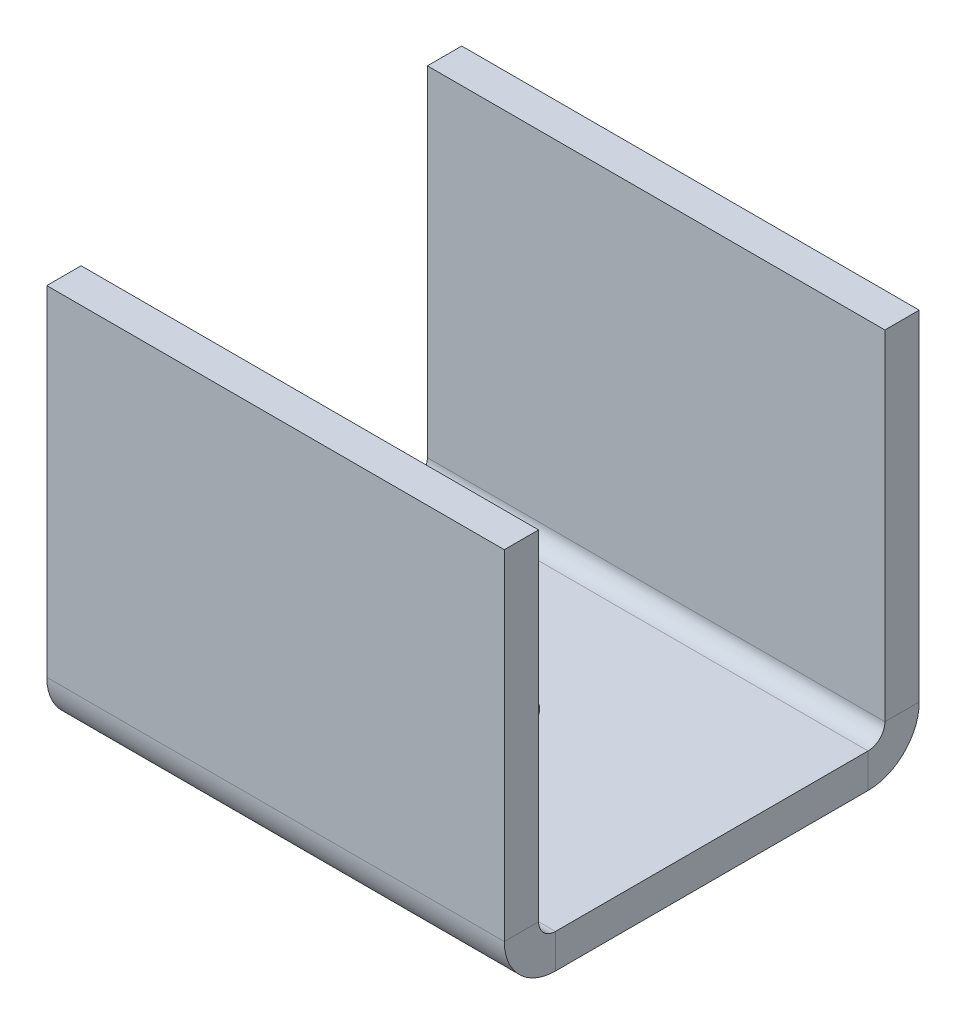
ISO-10303-21;
HEADER;
FILE_DESCRIPTION(('STEP AP214'),'2;1');
FILE_NAME('part.step','',(''),(''),'','','');
FILE_SCHEMA(('AUTOMOTIVE_DESIGN { 1 0 10303 214 1 1 1 1 }'));
ENDSEC;
DATA;
#1=APPLICATION_CONTEXT('core data for automotive mechanical design processes');
#2=APPLICATION_PROTOCOL_DEFINITION('international standard','automotive_design',2000,#1);
#3=PRODUCT_CONTEXT('',#1,'mechanical');
#4=PRODUCT('Part','Part','',(#3));
#5=PRODUCT_RELATED_PRODUCT_CATEGORY('part','',(#4));
#6=PRODUCT_DEFINITION_FORMATION('','',#4);
#7=PRODUCT_DEFINITION_CONTEXT('part definition',#1,'design');
#8=PRODUCT_DEFINITION('design','',#6,#7);
#9=PRODUCT_DEFINITION_SHAPE('','',#8);
#10=(LENGTH_UNIT() NAMED_UNIT(*) SI_UNIT(.MILLI.,.METRE.));
#11=(NAMED_UNIT(*) PLANE_ANGLE_UNIT() SI_UNIT($,.RADIAN.));
#12=(NAMED_UNIT(*) SI_UNIT($,.STERADIAN.) SOLID_ANGLE_UNIT());
#13=UNCERTAINTY_MEASURE_WITH_UNIT(LENGTH_MEASURE(1.E-05),#10,'distance_accuracy_value','');
#14=(GEOMETRIC_REPRESENTATION_CONTEXT(3) GLOBAL_UNCERTAINTY_ASSIGNED_CONTEXT((#13)) GLOBAL_UNIT_ASSIGNED_CONTEXT((#10,
#11,#12)) REPRESENTATION_CONTEXT('',''));
#15=CARTESIAN_POINT('',(0.,0.,0.));
#16=DIRECTION('',(0.,0.,1.));
#17=DIRECTION('',(1.,0.,0.));
#18=AXIS2_PLACEMENT_3D('',#15,#16,#17);
#19=CARTESIAN_POINT('',(0.,0.,-48.));
#20=DIRECTION('',(0.,-1.,0.));
#21=DIRECTION('',(0.,0.,-1.));
#22=AXIS2_PLACEMENT_3D('',#19,#20,#21);
#23=PLANE('',#22);
#24=CARTESIAN_POINT('',(10.,0.,-24.));
#25=DIRECTION('',(0.,1.,0.));
#26=DIRECTION('',(0.,0.,1.));
#27=AXIS2_PLACEMENT_3D('',#24,#25,#26);
#28=CIRCLE('',#27,1.75);
#29=CARTESIAN_POINT('',(10.,0.,-22.25));
#30=VERTEX_POINT('',#29);
#31=EDGE_CURVE('E230',#30,#30,#28,.T.);
#32=ORIENTED_EDGE('',*,*,#31,.T.);
#33=EDGE_LOOP('',(#32));
#34=FACE_BOUND('',#33,.T.);
#35=DIRECTION('',(0.,0.,1.));
#36=VECTOR('',#35,1.);
#37=CARTESIAN_POINT('',(0.,0.,0.));
#38=LINE('',#37,#36);
#39=CARTESIAN_POINT('',(0.,0.,-30.8324270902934));
#40=VERTEX_POINT('',#39);
#41=CARTESIAN_POINT('',(0.,1.20171815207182E-08,-17.1675729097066));
#42=VERTEX_POINT('',#41);
#43=EDGE_CURVE('E69',#40,#42,#38,.T.);
#44=ORIENTED_EDGE('',*,*,#43,.F.);
#45=DIRECTION('',(1.,0.,0.));
#46=VECTOR('',#45,1.);
#47=CARTESIAN_POINT('',(0.,0.,-30.8324270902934));
#48=LINE('',#47,#46);
#49=CARTESIAN_POINT('',(20.,0.,-30.8324270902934));
#50=VERTEX_POINT('',#49);
#51=EDGE_CURVE('E61',#40,#50,#48,.T.);
#52=ORIENTED_EDGE('',*,*,#51,.T.);
#53=DIRECTION('',(0.,0.,-1.));
#54=VECTOR('',#53,1.);
#55=CARTESIAN_POINT('',(20.,0.,0.));
#56=LINE('',#55,#54);
#57=CARTESIAN_POINT('',(20.,0.,-17.1675729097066));
#58=VERTEX_POINT('',#57);
#59=EDGE_CURVE('E77',#58,#50,#56,.T.);
#60=ORIENTED_EDGE('',*,*,#59,.F.);
#61=DIRECTION('',(1.,0.,0.));
#62=VECTOR('',#61,1.);
#63=CARTESIAN_POINT('',(0.,0.,-17.1675729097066));
#64=LINE('',#63,#62);
#65=EDGE_CURVE('E243',#42,#58,#64,.T.);
#66=ORIENTED_EDGE('',*,*,#65,.F.);
#67=EDGE_LOOP('',(#44,#52,#60,#66));
#68=FACE_BOUND('',#67,.T.);
#69=ADVANCED_FACE('F52',(#34,#68),#23,.T.);
#70=CARTESIAN_POINT('',(20.,1.5,0.));
#71=DIRECTION('',(-1.,0.,0.));
#72=DIRECTION('',(0.,0.,1.));
#73=AXIS2_PLACEMENT_3D('',#70,#71,#72);
#74=PLANE('',#73);
#75=DIRECTION('',(0.,-1.,0.));
#76=VECTOR('',#75,1.);
#77=CARTESIAN_POINT('',(20.,1.5,-30.8324270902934));
#78=LINE('',#77,#76);
#79=CARTESIAN_POINT('',(20.,1.5,-30.8324270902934));
#80=VERTEX_POINT('',#79);
#81=EDGE_CURVE('E250',#80,#50,#78,.T.);
#82=ORIENTED_EDGE('',*,*,#81,.F.);
#83=DIRECTION('',(0.,0.,-1.));
#84=VECTOR('',#83,1.);
#85=CARTESIAN_POINT('',(20.,1.5,0.));
#86=LINE('',#85,#84);
#87=CARTESIAN_POINT('',(20.,1.50000000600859,-17.1675729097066));
#88=VERTEX_POINT('',#87);
#89=EDGE_CURVE('E240',#88,#80,#86,.T.);
#90=ORIENTED_EDGE('',*,*,#89,.F.);
#91=DIRECTION('',(0.,-1.,0.));
#92=VECTOR('',#91,1.);
#93=CARTESIAN_POINT('',(20.,1.5,-17.1675729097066));
#94=LINE('',#93,#92);
#95=EDGE_CURVE('E245',#88,#58,#94,.T.);
#96=ORIENTED_EDGE('',*,*,#95,.T.);
#97=ORIENTED_EDGE('',*,*,#59,.T.);
#98=EDGE_LOOP('',(#82,#90,#96,#97));
#99=FACE_BOUND('',#98,.T.);
#100=ADVANCED_FACE('F298',(#99),#74,.F.);
#101=CARTESIAN_POINT('',(0.,1.5,0.));
#102=DIRECTION('',(1.,0.,0.));
#103=DIRECTION('',(0.,0.,-1.));
#104=AXIS2_PLACEMENT_3D('',#101,#102,#103);
#105=PLANE('',#104);
#106=DIRECTION('',(0.,1.,0.));
#107=VECTOR('',#106,1.);
#108=CARTESIAN_POINT('',(0.,1.5,-30.8324270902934));
#109=LINE('',#108,#107);
#110=CARTESIAN_POINT('',(0.,1.49999998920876,-30.8324270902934));
#111=VERTEX_POINT('',#110);
#112=EDGE_CURVE('E14',#40,#111,#109,.T.);
#113=ORIENTED_EDGE('',*,*,#112,.F.);
#114=ORIENTED_EDGE('',*,*,#43,.T.);
#115=DIRECTION('',(0.,1.,0.));
#116=VECTOR('',#115,1.);
#117=CARTESIAN_POINT('',(0.,1.5,-17.1675729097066));
#118=LINE('',#117,#116);
#119=CARTESIAN_POINT('',(0.,1.50000000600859,-17.1675729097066));
#120=VERTEX_POINT('',#119);
#121=EDGE_CURVE('E239',#42,#120,#118,.T.);
#122=ORIENTED_EDGE('',*,*,#121,.T.);
#123=DIRECTION('',(0.,0.,1.));
#124=VECTOR('',#123,1.);
#125=CARTESIAN_POINT('',(0.,1.5,0.));
#126=LINE('',#125,#124);
#127=EDGE_CURVE('E56',#111,#120,#126,.T.);
#128=ORIENTED_EDGE('',*,*,#127,.F.);
#129=EDGE_LOOP('',(#113,#114,#122,#128));
#130=FACE_BOUND('',#129,.T.);
#131=ADVANCED_FACE('F54',(#130),#105,.F.);
#132=CARTESIAN_POINT('',(0.,1.5,-48.));
#133=DIRECTION('',(0.,-1.,0.));
#134=DIRECTION('',(0.,0.,-1.));
#135=AXIS2_PLACEMENT_3D('',#132,#133,#134);
#136=PLANE('',#135);
#137=DIRECTION('',(1.,0.,0.));
#138=VECTOR('',#137,1.);
#139=CARTESIAN_POINT('',(0.,1.5,-30.8324270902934));
#140=LINE('',#139,#138);
#141=EDGE_CURVE('E247',#111,#80,#140,.T.);
#142=ORIENTED_EDGE('',*,*,#141,.F.);
#143=ORIENTED_EDGE('',*,*,#127,.T.);
#144=DIRECTION('',(1.,0.,0.));
#145=VECTOR('',#144,1.);
#146=CARTESIAN_POINT('',(0.,1.5,-17.1675729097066));
#147=LINE('',#146,#145);
#148=EDGE_CURVE('E236',#120,#88,#147,.T.);
#149=ORIENTED_EDGE('',*,*,#148,.T.);
#150=ORIENTED_EDGE('',*,*,#89,.T.);
#151=EDGE_LOOP('',(#142,#143,#149,#150));
#152=FACE_BOUND('',#151,.T.);
#153=CARTESIAN_POINT('',(10.,1.5,-24.));
#154=DIRECTION('',(0.,1.,0.));
#155=DIRECTION('',(0.,0.,1.));
#156=AXIS2_PLACEMENT_3D('',#153,#154,#155);
#157=CIRCLE('',#156,1.75);
#158=CARTESIAN_POINT('',(10.,1.5,-22.25));
#159=VERTEX_POINT('',#158);
#160=EDGE_CURVE('E233',#159,#159,#157,.T.);
#161=ORIENTED_EDGE('',*,*,#160,.F.);
#162=EDGE_LOOP('',(#161));
#163=FACE_BOUND('',#162,.T.);
#164=ADVANCED_FACE('F259',(#152,#163),#136,.F.);
#165=CARTESIAN_POINT('',(10.,1.5,-24.));
#166=DIRECTION('',(0.,-1.,0.));
#167=DIRECTION('',(0.,0.,-1.));
#168=AXIS2_PLACEMENT_3D('',#165,#166,#167);
#169=CYLINDRICAL_SURFACE('',#168,1.75);
#170=ORIENTED_EDGE('',*,*,#160,.T.);
#171=EDGE_LOOP('',(#170));
#172=FACE_BOUND('',#171,.T.);
#173=ORIENTED_EDGE('',*,*,#31,.F.);
#174=EDGE_LOOP('',(#173));
#175=FACE_BOUND('',#174,.T.);
#176=ADVANCED_FACE('F307',(#172,#175),#169,.F.);
#177=CARTESIAN_POINT('',(0.,2.23659998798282,-17.1675729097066));
#178=DIRECTION('',(1.,0.,0.));
#179=DIRECTION('',(0.,0.,-1.));
#180=AXIS2_PLACEMENT_3D('',#177,#178,#179);
#181=PLANE('',#180);
#182=ORIENTED_EDGE('',*,*,#121,.F.);
#183=CARTESIAN_POINT('',(0.,2.2366,-17.1675729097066));
#184=DIRECTION('',(1.,0.,0.));
#185=DIRECTION('',(0.,0.,-1.));
#186=AXIS2_PLACEMENT_3D('',#183,#184,#185);
#187=CIRCLE('',#186,2.23659998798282);
#188=CARTESIAN_POINT('',(0.,2.23660000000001,-14.9309729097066));
#189=VERTEX_POINT('',#188);
#190=EDGE_CURVE('E190',#42,#189,#187,.F.);
#191=ORIENTED_EDGE('',*,*,#190,.T.);
#192=DIRECTION('',(0.,0.,-1.));
#193=VECTOR('',#192,1.);
#194=CARTESIAN_POINT('',(0.,2.2366,-16.4309729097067));
#195=LINE('',#194,#193);
#196=CARTESIAN_POINT('',(0.,2.2366,-16.4309729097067));
#197=VERTEX_POINT('',#196);
#198=EDGE_CURVE('E211',#189,#197,#195,.T.);
#199=ORIENTED_EDGE('',*,*,#198,.T.);
#200=CARTESIAN_POINT('',(0.,2.23659998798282,-17.1675729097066));
#201=DIRECTION('',(-1.,0.,0.));
#202=DIRECTION('',(0.,0.,1.));
#203=AXIS2_PLACEMENT_3D('',#200,#201,#202);
#204=CIRCLE('',#203,0.736599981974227);
#205=EDGE_CURVE('E222',#120,#197,#204,.T.);
#206=ORIENTED_EDGE('',*,*,#205,.F.);
#207=EDGE_LOOP('',(#182,#191,#199,#206));
#208=FACE_BOUND('',#207,.T.);
#209=ADVANCED_FACE('F265',(#208),#181,.F.);
#210=CARTESIAN_POINT('',(20.,2.23659998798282,-17.1675729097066));
#211=DIRECTION('',(-1.,0.,0.));
#212=DIRECTION('',(0.,0.,1.));
#213=AXIS2_PLACEMENT_3D('',#210,#211,#212);
#214=PLANE('',#213);
#215=DIRECTION('',(0.,0.,1.));
#216=VECTOR('',#215,1.);
#217=CARTESIAN_POINT('',(20.,2.2366,-16.4309729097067));
#218=LINE('',#217,#216);
#219=CARTESIAN_POINT('',(20.,2.2366,-16.4309729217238));
#220=VERTEX_POINT('',#219);
#221=CARTESIAN_POINT('',(20.,2.23660000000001,-14.9309729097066));
#222=VERTEX_POINT('',#221);
#223=EDGE_CURVE('E214',#220,#222,#218,.T.);
#224=ORIENTED_EDGE('',*,*,#223,.T.);
#225=CARTESIAN_POINT('',(20.,2.2366,-17.1675729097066));
#226=DIRECTION('',(1.,0.,0.));
#227=DIRECTION('',(0.,0.,-1.));
#228=AXIS2_PLACEMENT_3D('',#225,#226,#227);
#229=CIRCLE('',#228,2.23659998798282);
#230=EDGE_CURVE('E219',#222,#58,#229,.T.);
#231=ORIENTED_EDGE('',*,*,#230,.T.);
#232=ORIENTED_EDGE('',*,*,#95,.F.);
#233=CARTESIAN_POINT('',(20.,2.23659998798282,-17.1675729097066));
#234=DIRECTION('',(1.,0.,0.));
#235=DIRECTION('',(0.,0.,-1.));
#236=AXIS2_PLACEMENT_3D('',#233,#234,#235);
#237=CIRCLE('',#236,0.736599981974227);
#238=EDGE_CURVE('E227',#220,#88,#237,.T.);
#239=ORIENTED_EDGE('',*,*,#238,.F.);
#240=EDGE_LOOP('',(#224,#231,#232,#239));
#241=FACE_BOUND('',#240,.T.);
#242=ADVANCED_FACE('F277',(#241),#214,.F.);
#243=CARTESIAN_POINT('',(-10.1916543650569,2.2366,-17.1675729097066));
#244=DIRECTION('',(1.,0.,0.));
#245=DIRECTION('',(0.,0.,-1.));
#246=AXIS2_PLACEMENT_3D('',#243,#244,#245);
#247=CYLINDRICAL_SURFACE('',#246,0.736599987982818);
#248=ORIENTED_EDGE('',*,*,#238,.T.);
#249=ORIENTED_EDGE('',*,*,#148,.F.);
#250=ORIENTED_EDGE('',*,*,#205,.T.);
#251=DIRECTION('',(1.,0.,0.));
#252=VECTOR('',#251,1.);
#253=CARTESIAN_POINT('',(0.,2.2366,-16.4309729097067));
#254=LINE('',#253,#252);
#255=EDGE_CURVE('E187',#197,#220,#254,.T.);
#256=ORIENTED_EDGE('',*,*,#255,.T.);
#257=EDGE_LOOP('',(#248,#249,#250,#256));
#258=FACE_BOUND('',#257,.T.);
#259=ADVANCED_FACE('F287',(#258),#247,.F.);
#260=CARTESIAN_POINT('',(-10.1916543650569,2.2366,-17.1675729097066));
#261=DIRECTION('',(1.,0.,0.));
#262=DIRECTION('',(0.,0.,-1.));
#263=AXIS2_PLACEMENT_3D('',#260,#261,#262);
#264=CYLINDRICAL_SURFACE('',#263,2.23659998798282);
#265=ORIENTED_EDGE('',*,*,#230,.F.);
#266=DIRECTION('',(1.,0.,0.));
#267=VECTOR('',#266,1.);
#268=CARTESIAN_POINT('',(0.,2.23660000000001,-14.9309729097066));
#269=LINE('',#268,#267);
#270=EDGE_CURVE('E194',#189,#222,#269,.T.);
#271=ORIENTED_EDGE('',*,*,#270,.F.);
#272=ORIENTED_EDGE('',*,*,#190,.F.);
#273=ORIENTED_EDGE('',*,*,#65,.T.);
#274=EDGE_LOOP('',(#265,#271,#272,#273));
#275=FACE_BOUND('',#274,.T.);
#276=ADVANCED_FACE('F269',(#275),#264,.T.);
#277=CARTESIAN_POINT('',(0.,17.0690270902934,-16.4309729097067));
#278=DIRECTION('',(0.,-1.,0.));
#279=DIRECTION('',(-1.,0.,0.));
#280=AXIS2_PLACEMENT_3D('',#277,#278,#279);
#281=PLANE('',#280);
#282=DIRECTION('',(1.,0.,0.));
#283=VECTOR('',#282,1.);
#284=CARTESIAN_POINT('',(0.,17.0690270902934,-14.9309729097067));
#285=LINE('',#284,#283);
#286=CARTESIAN_POINT('',(0.,17.0690270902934,-14.9309729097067));
#287=VERTEX_POINT('',#286);
#288=CARTESIAN_POINT('',(20.,17.0690270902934,-14.9309729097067));
#289=VERTEX_POINT('',#288);
#290=EDGE_CURVE('E209',#287,#289,#285,.T.);
#291=ORIENTED_EDGE('',*,*,#290,.T.);
#292=DIRECTION('',(0.,0.,1.));
#293=VECTOR('',#292,1.);
#294=CARTESIAN_POINT('',(20.,17.0690270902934,-16.4309729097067));
#295=LINE('',#294,#293);
#296=CARTESIAN_POINT('',(20.,17.0690270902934,-16.4309729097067));
#297=VERTEX_POINT('',#296);
#298=EDGE_CURVE('E191',#297,#289,#295,.T.);
#299=ORIENTED_EDGE('',*,*,#298,.F.);
#300=DIRECTION('',(1.,0.,0.));
#301=VECTOR('',#300,1.);
#302=CARTESIAN_POINT('',(0.,17.0690270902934,-16.4309729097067));
#303=LINE('',#302,#301);
#304=CARTESIAN_POINT('',(0.,17.0690270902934,-16.4309729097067));
#305=VERTEX_POINT('',#304);
#306=EDGE_CURVE('E202',#305,#297,#303,.T.);
#307=ORIENTED_EDGE('',*,*,#306,.F.);
#308=DIRECTION('',(0.,0.,1.));
#309=VECTOR('',#308,1.);
#310=CARTESIAN_POINT('',(0.,17.0690270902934,-16.4309729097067));
#311=LINE('',#310,#309);
#312=EDGE_CURVE('E206',#305,#287,#311,.T.);
#313=ORIENTED_EDGE('',*,*,#312,.T.);
#314=EDGE_LOOP('',(#291,#299,#307,#313));
#315=FACE_BOUND('',#314,.T.);
#316=ADVANCED_FACE('F294',(#315),#281,.F.);
#317=CARTESIAN_POINT('',(0.,-30.9309729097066,-16.4309729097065));
#318=DIRECTION('',(0.,0.,1.));
#319=DIRECTION('',(0.,-1.,0.));
#320=AXIS2_PLACEMENT_3D('',#317,#318,#319);
#321=PLANE('',#320);
#322=ORIENTED_EDGE('',*,*,#255,.F.);
#323=DIRECTION('',(0.,1.,0.));
#324=VECTOR('',#323,1.);
#325=CARTESIAN_POINT('',(0.,17.0690270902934,-16.4309729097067));
#326=LINE('',#325,#324);
#327=EDGE_CURVE('E204',#197,#305,#326,.T.);
#328=ORIENTED_EDGE('',*,*,#327,.T.);
#329=ORIENTED_EDGE('',*,*,#306,.T.);
#330=DIRECTION('',(0.,-1.,0.));
#331=VECTOR('',#330,1.);
#332=CARTESIAN_POINT('',(20.,17.0690270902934,-16.4309729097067));
#333=LINE('',#332,#331);
#334=EDGE_CURVE('E199',#297,#220,#333,.T.);
#335=ORIENTED_EDGE('',*,*,#334,.T.);
#336=EDGE_LOOP('',(#322,#328,#329,#335));
#337=FACE_BOUND('',#336,.T.);
#338=ADVANCED_FACE('F282',(#337),#321,.F.);
#339=CARTESIAN_POINT('',(0.,17.0690270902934,-16.4309729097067));
#340=DIRECTION('',(1.,0.,0.));
#341=DIRECTION('',(0.,-1.,0.));
#342=AXIS2_PLACEMENT_3D('',#339,#340,#341);
#343=PLANE('',#342);
#344=ORIENTED_EDGE('',*,*,#198,.F.);
#345=DIRECTION('',(0.,1.,0.));
#346=VECTOR('',#345,1.);
#347=CARTESIAN_POINT('',(0.,17.0690270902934,-14.9309729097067));
#348=LINE('',#347,#346);
#349=EDGE_CURVE('E197',#189,#287,#348,.T.);
#350=ORIENTED_EDGE('',*,*,#349,.T.);
#351=ORIENTED_EDGE('',*,*,#312,.F.);
#352=ORIENTED_EDGE('',*,*,#327,.F.);
#353=EDGE_LOOP('',(#344,#350,#351,#352));
#354=FACE_BOUND('',#353,.T.);
#355=ADVANCED_FACE('F355',(#354),#343,.F.);
#356=CARTESIAN_POINT('',(0.,-30.9309729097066,-14.9309729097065));
#357=DIRECTION('',(0.,0.,1.));
#358=DIRECTION('',(0.,-1.,0.));
#359=AXIS2_PLACEMENT_3D('',#356,#357,#358);
#360=PLANE('',#359);
#361=ORIENTED_EDGE('',*,*,#349,.F.);
#362=ORIENTED_EDGE('',*,*,#270,.T.);
#363=DIRECTION('',(0.,-1.,0.));
#364=VECTOR('',#363,1.);
#365=CARTESIAN_POINT('',(20.,17.0690270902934,-14.9309729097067));
#366=LINE('',#365,#364);
#367=EDGE_CURVE('E188',#289,#222,#366,.T.);
#368=ORIENTED_EDGE('',*,*,#367,.F.);
#369=ORIENTED_EDGE('',*,*,#290,.F.);
#370=EDGE_LOOP('',(#361,#362,#368,#369));
#371=FACE_BOUND('',#370,.T.);
#372=ADVANCED_FACE('F272',(#371),#360,.T.);
#373=CARTESIAN_POINT('',(20.,17.0690270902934,-16.4309729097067));
#374=DIRECTION('',(-1.,0.,0.));
#375=DIRECTION('',(0.,1.,0.));
#376=AXIS2_PLACEMENT_3D('',#373,#374,#375);
#377=PLANE('',#376);
#378=ORIENTED_EDGE('',*,*,#223,.F.);
#379=ORIENTED_EDGE('',*,*,#334,.F.);
#380=ORIENTED_EDGE('',*,*,#298,.T.);
#381=ORIENTED_EDGE('',*,*,#367,.T.);
#382=EDGE_LOOP('',(#378,#379,#380,#381));
#383=FACE_BOUND('',#382,.T.);
#384=ADVANCED_FACE('F280',(#383),#377,.F.);
#385=CARTESIAN_POINT('',(0.,2.23660002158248,-30.8324270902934));
#386=DIRECTION('',(1.,0.,0.));
#387=DIRECTION('',(0.,0.,-1.));
#388=AXIS2_PLACEMENT_3D('',#385,#386,#387);
#389=PLANE('',#388);
#390=DIRECTION('',(0.,0.,1.));
#391=VECTOR('',#390,1.);
#392=CARTESIAN_POINT('',(0.,2.2366,-31.5690270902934));
#393=LINE('',#392,#391);
#394=CARTESIAN_POINT('',(0.,2.23660000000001,-33.0690270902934));
#395=VERTEX_POINT('',#394);
#396=CARTESIAN_POINT('',(0.,2.2366,-31.5690270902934));
#397=VERTEX_POINT('',#396);
#398=EDGE_CURVE('E539',#395,#397,#393,.T.);
#399=ORIENTED_EDGE('',*,*,#398,.F.);
#400=CARTESIAN_POINT('',(0.,2.2366,-30.8324270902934));
#401=DIRECTION('',(-1.,0.,0.));
#402=DIRECTION('',(0.,0.,1.));
#403=AXIS2_PLACEMENT_3D('',#400,#401,#402);
#404=CIRCLE('',#403,2.23660002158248);
#405=EDGE_CURVE('E178',#395,#40,#404,.T.);
#406=ORIENTED_EDGE('',*,*,#405,.T.);
#407=ORIENTED_EDGE('',*,*,#112,.T.);
#408=CARTESIAN_POINT('',(0.,2.23660002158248,-30.8324270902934));
#409=DIRECTION('',(-1.,0.,0.));
#410=DIRECTION('',(0.,0.,1.));
#411=AXIS2_PLACEMENT_3D('',#408,#409,#410);
#412=CIRCLE('',#411,0.736600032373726);
#413=EDGE_CURVE('E177',#397,#111,#412,.T.);
#414=ORIENTED_EDGE('',*,*,#413,.F.);
#415=EDGE_LOOP('',(#399,#406,#407,#414));
#416=FACE_BOUND('',#415,.T.);
#417=ADVANCED_FACE('F384',(#416),#389,.F.);
#418=CARTESIAN_POINT('',(20.,2.23660002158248,-30.8324270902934));
#419=DIRECTION('',(-1.,0.,0.));
#420=DIRECTION('',(0.,0.,1.));
#421=AXIS2_PLACEMENT_3D('',#418,#419,#420);
#422=PLANE('',#421);
#423=ORIENTED_EDGE('',*,*,#81,.T.);
#424=CARTESIAN_POINT('',(20.,2.2366,-30.8324270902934));
#425=DIRECTION('',(-1.,0.,0.));
#426=DIRECTION('',(0.,0.,1.));
#427=AXIS2_PLACEMENT_3D('',#424,#425,#426);
#428=CIRCLE('',#427,2.23660002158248);
#429=CARTESIAN_POINT('',(20.,2.23660000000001,-33.0690270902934));
#430=VERTEX_POINT('',#429);
#431=EDGE_CURVE('E175',#50,#430,#428,.F.);
#432=ORIENTED_EDGE('',*,*,#431,.T.);
#433=DIRECTION('',(0.,0.,-1.));
#434=VECTOR('',#433,1.);
#435=CARTESIAN_POINT('',(20.,2.2366,-31.5690270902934));
#436=LINE('',#435,#434);
#437=CARTESIAN_POINT('',(20.,2.2366,-31.5690271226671));
#438=VERTEX_POINT('',#437);
#439=EDGE_CURVE('E152',#438,#430,#436,.T.);
#440=ORIENTED_EDGE('',*,*,#439,.F.);
#441=CARTESIAN_POINT('',(20.,2.23660002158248,-30.8324270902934));
#442=DIRECTION('',(1.,0.,0.));
#443=DIRECTION('',(0.,0.,-1.));
#444=AXIS2_PLACEMENT_3D('',#441,#442,#443);
#445=CIRCLE('',#444,0.736600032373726);
#446=EDGE_CURVE('E184',#80,#438,#445,.T.);
#447=ORIENTED_EDGE('',*,*,#446,.F.);
#448=EDGE_LOOP('',(#423,#432,#440,#447));
#449=FACE_BOUND('',#448,.T.);
#450=ADVANCED_FACE('F394',(#449),#422,.F.);
#451=CARTESIAN_POINT('',(30.1916543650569,2.2366,-30.8324270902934));
#452=DIRECTION('',(-1.,0.,0.));
#453=DIRECTION('',(0.,0.,1.));
#454=AXIS2_PLACEMENT_3D('',#451,#452,#453);
#455=CYLINDRICAL_SURFACE('',#454,0.736600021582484);
#456=ORIENTED_EDGE('',*,*,#446,.T.);
#457=DIRECTION('',(1.,0.,0.));
#458=VECTOR('',#457,1.);
#459=CARTESIAN_POINT('',(0.,2.2366,-31.5690270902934));
#460=LINE('',#459,#458);
#461=EDGE_CURVE('E549',#397,#438,#460,.T.);
#462=ORIENTED_EDGE('',*,*,#461,.F.);
#463=ORIENTED_EDGE('',*,*,#413,.T.);
#464=ORIENTED_EDGE('',*,*,#141,.T.);
#465=EDGE_LOOP('',(#456,#462,#463,#464));
#466=FACE_BOUND('',#465,.T.);
#467=ADVANCED_FACE('F405',(#466),#455,.F.);
#468=CARTESIAN_POINT('',(30.1916543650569,2.2366,-30.8324270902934));
#469=DIRECTION('',(-1.,0.,0.));
#470=DIRECTION('',(0.,0.,1.));
#471=AXIS2_PLACEMENT_3D('',#468,#469,#470);
#472=CYLINDRICAL_SURFACE('',#471,2.23660002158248);
#473=ORIENTED_EDGE('',*,*,#431,.F.);
#474=ORIENTED_EDGE('',*,*,#51,.F.);
#475=ORIENTED_EDGE('',*,*,#405,.F.);
#476=DIRECTION('',(1.,0.,0.));
#477=VECTOR('',#476,1.);
#478=CARTESIAN_POINT('',(0.,2.23660000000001,-33.0690270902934));
#479=LINE('',#478,#477);
#480=EDGE_CURVE('E169',#395,#430,#479,.T.);
#481=ORIENTED_EDGE('',*,*,#480,.T.);
#482=EDGE_LOOP('',(#473,#474,#475,#481));
#483=FACE_BOUND('',#482,.T.);
#484=ADVANCED_FACE('F416',(#483),#472,.T.);
#485=CARTESIAN_POINT('',(0.,17.0690270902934,-31.5690270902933));
#486=DIRECTION('',(0.,-1.,0.));
#487=DIRECTION('',(1.,0.,0.));
#488=AXIS2_PLACEMENT_3D('',#485,#486,#487);
#489=PLANE('',#488);
#490=DIRECTION('',(-1.,0.,0.));
#491=VECTOR('',#490,1.);
#492=CARTESIAN_POINT('',(0.,17.0690270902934,-33.0690270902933));
#493=LINE('',#492,#491);
#494=CARTESIAN_POINT('',(20.,17.0690270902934,-33.0690270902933));
#495=VERTEX_POINT('',#494);
#496=CARTESIAN_POINT('',(0.,17.0690270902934,-33.0690270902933));
#497=VERTEX_POINT('',#496);
#498=EDGE_CURVE('E162',#495,#497,#493,.T.);
#499=ORIENTED_EDGE('',*,*,#498,.T.);
#500=DIRECTION('',(0.,0.,-1.));
#501=VECTOR('',#500,1.);
#502=CARTESIAN_POINT('',(0.,17.0690270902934,-31.5690270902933));
#503=LINE('',#502,#501);
#504=CARTESIAN_POINT('',(0.,17.0690270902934,-31.5690270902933));
#505=VERTEX_POINT('',#504);
#506=EDGE_CURVE('E181',#505,#497,#503,.T.);
#507=ORIENTED_EDGE('',*,*,#506,.F.);
#508=DIRECTION('',(-1.,0.,0.));
#509=VECTOR('',#508,1.);
#510=CARTESIAN_POINT('',(0.,17.0690270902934,-31.5690270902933));
#511=LINE('',#510,#509);
#512=CARTESIAN_POINT('',(20.,17.0690270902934,-31.5690270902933));
#513=VERTEX_POINT('',#512);
#514=EDGE_CURVE('E164',#513,#505,#511,.T.);
#515=ORIENTED_EDGE('',*,*,#514,.F.);
#516=DIRECTION('',(0.,0.,-1.));
#517=VECTOR('',#516,1.);
#518=CARTESIAN_POINT('',(20.,17.0690270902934,-31.5690270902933));
#519=LINE('',#518,#517);
#520=EDGE_CURVE('E149',#513,#495,#519,.T.);
#521=ORIENTED_EDGE('',*,*,#520,.T.);
#522=EDGE_LOOP('',(#499,#507,#515,#521));
#523=FACE_BOUND('',#522,.T.);
#524=ADVANCED_FACE('F160',(#523),#489,.F.);
#525=CARTESIAN_POINT('',(0.,17.0690270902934,-31.5690270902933));
#526=DIRECTION('',(0.,0.,-1.));
#527=DIRECTION('',(0.,1.,0.));
#528=AXIS2_PLACEMENT_3D('',#525,#526,#527);
#529=PLANE('',#528);
#530=DIRECTION('',(0.,-1.,0.));
#531=VECTOR('',#530,1.);
#532=CARTESIAN_POINT('',(0.,-30.9309729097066,-31.5690270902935));
#533=LINE('',#532,#531);
#534=EDGE_CURVE('E165',#505,#397,#533,.T.);
#535=ORIENTED_EDGE('',*,*,#534,.T.);
#536=ORIENTED_EDGE('',*,*,#461,.T.);
#537=DIRECTION('',(0.,1.,0.));
#538=VECTOR('',#537,1.);
#539=CARTESIAN_POINT('',(20.,-30.9309729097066,-31.5690270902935));
#540=LINE('',#539,#538);
#541=EDGE_CURVE('E550',#438,#513,#540,.T.);
#542=ORIENTED_EDGE('',*,*,#541,.T.);
#543=ORIENTED_EDGE('',*,*,#514,.T.);
#544=EDGE_LOOP('',(#535,#536,#542,#543));
#545=FACE_BOUND('',#544,.T.);
#546=ADVANCED_FACE('F437',(#545),#529,.F.);
#547=CARTESIAN_POINT('',(20.,-30.9309729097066,-31.5690270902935));
#548=DIRECTION('',(-1.,0.,0.));
#549=DIRECTION('',(0.,-1.,0.));
#550=AXIS2_PLACEMENT_3D('',#547,#548,#549);
#551=PLANE('',#550);
#552=ORIENTED_EDGE('',*,*,#541,.F.);
#553=ORIENTED_EDGE('',*,*,#439,.T.);
#554=DIRECTION('',(0.,1.,0.));
#555=VECTOR('',#554,1.);
#556=CARTESIAN_POINT('',(20.,-30.9309729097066,-33.0690270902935));
#557=LINE('',#556,#555);
#558=EDGE_CURVE('E146',#430,#495,#557,.T.);
#559=ORIENTED_EDGE('',*,*,#558,.T.);
#560=ORIENTED_EDGE('',*,*,#520,.F.);
#561=EDGE_LOOP('',(#552,#553,#559,#560));
#562=FACE_BOUND('',#561,.T.);
#563=ADVANCED_FACE('F148',(#562),#551,.F.);
#564=CARTESIAN_POINT('',(0.,17.0690270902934,-33.0690270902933));
#565=DIRECTION('',(0.,0.,-1.));
#566=DIRECTION('',(0.,1.,0.));
#567=AXIS2_PLACEMENT_3D('',#564,#565,#566);
#568=PLANE('',#567);
#569=ORIENTED_EDGE('',*,*,#480,.F.);
#570=DIRECTION('',(0.,-1.,0.));
#571=VECTOR('',#570,1.);
#572=CARTESIAN_POINT('',(0.,-30.9309729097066,-33.0690270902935));
#573=LINE('',#572,#571);
#574=EDGE_CURVE('E157',#497,#395,#573,.T.);
#575=ORIENTED_EDGE('',*,*,#574,.F.);
#576=ORIENTED_EDGE('',*,*,#498,.F.);
#577=ORIENTED_EDGE('',*,*,#558,.F.);
#578=EDGE_LOOP('',(#569,#575,#576,#577));
#579=FACE_BOUND('',#578,.T.);
#580=ADVANCED_FACE('F168',(#579),#568,.T.);
#581=CARTESIAN_POINT('',(0.,-30.9309729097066,-31.5690270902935));
#582=DIRECTION('',(1.,0.,0.));
#583=DIRECTION('',(0.,1.,0.));
#584=AXIS2_PLACEMENT_3D('',#581,#582,#583);
#585=PLANE('',#584);
#586=ORIENTED_EDGE('',*,*,#574,.T.);
#587=ORIENTED_EDGE('',*,*,#398,.T.);
#588=ORIENTED_EDGE('',*,*,#534,.F.);
#589=ORIENTED_EDGE('',*,*,#506,.T.);
#590=EDGE_LOOP('',(#586,#587,#588,#589));
#591=FACE_BOUND('',#590,.T.);
#592=ADVANCED_FACE('F466',(#591),#585,.F.);
#593=CLOSED_SHELL('',(#69,#100,#131,#164,#176,#209,#242,#259,#276,#316,#338,#355,#372,#384,#417,
#450,#467,#484,#524,#546,#563,#580,#592));
#594=MANIFOLD_SOLID_BREP('B2',#593);
#595=ADVANCED_BREP_SHAPE_REPRESENTATION('',(#18,#594),#14);
#596=SHAPE_DEFINITION_REPRESENTATION(#9,#595);
ENDSEC;
END-ISO-10303-21;
